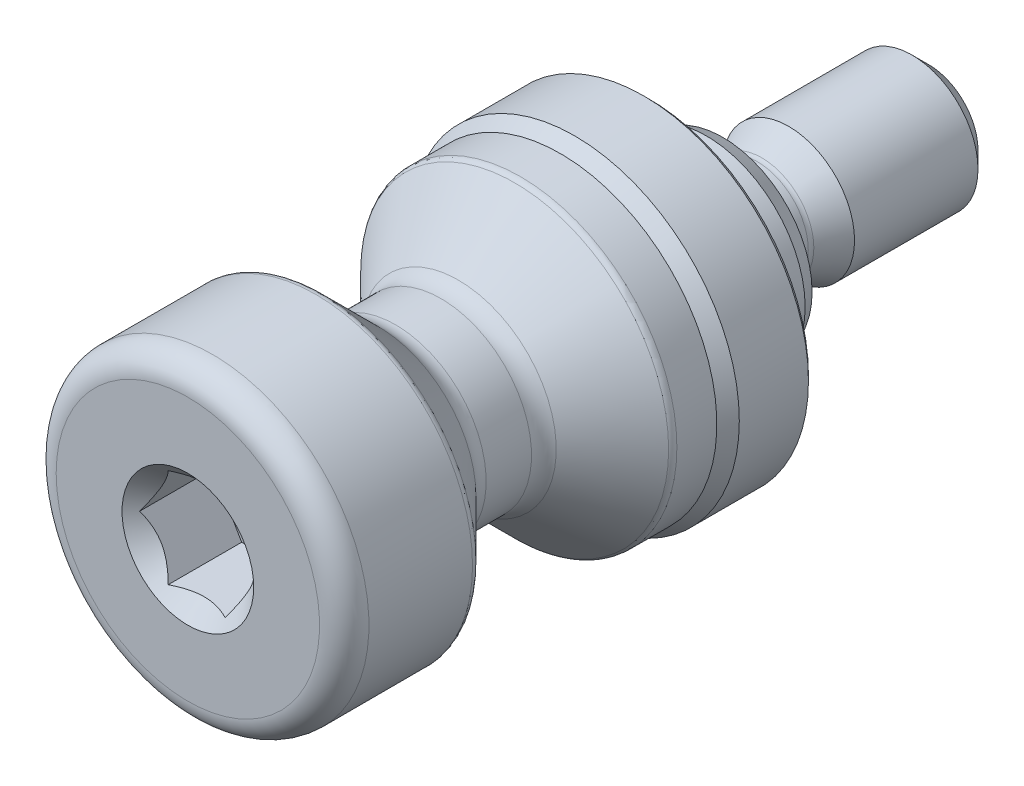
ISO-10303-21;
HEADER;
FILE_DESCRIPTION(('STEP AP214'),'2;1');
FILE_NAME('part.step','',(''),(''),'','','');
FILE_SCHEMA(('AUTOMOTIVE_DESIGN { 1 0 10303 214 1 1 1 1 }'));
ENDSEC;
DATA;
#1=APPLICATION_CONTEXT('core data for automotive mechanical design processes');
#2=APPLICATION_PROTOCOL_DEFINITION('international standard','automotive_design',2000,#1);
#3=PRODUCT_CONTEXT('',#1,'mechanical');
#4=PRODUCT('Part','Part','',(#3));
#5=PRODUCT_RELATED_PRODUCT_CATEGORY('part','',(#4));
#6=PRODUCT_DEFINITION_FORMATION('','',#4);
#7=PRODUCT_DEFINITION_CONTEXT('part definition',#1,'design');
#8=PRODUCT_DEFINITION('design','',#6,#7);
#9=PRODUCT_DEFINITION_SHAPE('','',#8);
#10=(LENGTH_UNIT() NAMED_UNIT(*) SI_UNIT(.MILLI.,.METRE.));
#11=(NAMED_UNIT(*) PLANE_ANGLE_UNIT() SI_UNIT($,.RADIAN.));
#12=(NAMED_UNIT(*) SI_UNIT($,.STERADIAN.) SOLID_ANGLE_UNIT());
#13=UNCERTAINTY_MEASURE_WITH_UNIT(LENGTH_MEASURE(1.E-05),#10,'distance_accuracy_value','');
#14=(GEOMETRIC_REPRESENTATION_CONTEXT(3) GLOBAL_UNCERTAINTY_ASSIGNED_CONTEXT((#13)) GLOBAL_UNIT_ASSIGNED_CONTEXT((#10,
#11,#12)) REPRESENTATION_CONTEXT('',''));
#15=CARTESIAN_POINT('',(0.,0.,0.));
#16=DIRECTION('',(0.,0.,1.));
#17=DIRECTION('',(1.,0.,0.));
#18=AXIS2_PLACEMENT_3D('',#15,#16,#17);
#19=CARTESIAN_POINT('',(0.,0.,-17.));
#20=DIRECTION('',(0.,0.,-1.));
#21=DIRECTION('',(-1.,0.,0.));
#22=AXIS2_PLACEMENT_3D('',#19,#20,#21);
#23=CYLINDRICAL_SURFACE('',#22,9.5);
#24=CARTESIAN_POINT('',(0.,0.,7.79289321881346));
#25=DIRECTION('',(0.,0.,1.));
#26=DIRECTION('',(1.,0.,0.));
#27=AXIS2_PLACEMENT_3D('',#24,#25,#26);
#28=CIRCLE('',#27,9.5);
#29=CARTESIAN_POINT('',(9.5,0.,7.79289321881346));
#30=VERTEX_POINT('',#29);
#31=EDGE_CURVE('E235',#30,#30,#28,.F.);
#32=ORIENTED_EDGE('',*,*,#31,.T.);
#33=EDGE_LOOP('',(#32));
#34=FACE_BOUND('',#33,.T.);
#35=CARTESIAN_POINT('',(0.,0.,5.36602540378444));
#36=DIRECTION('',(0.,0.,-1.));
#37=DIRECTION('',(-1.,0.,0.));
#38=AXIS2_PLACEMENT_3D('',#35,#36,#37);
#39=CIRCLE('',#38,9.5);
#40=CARTESIAN_POINT('',(-9.5,0.,5.36602540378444));
#41=VERTEX_POINT('',#40);
#42=EDGE_CURVE('E115',#41,#41,#39,.T.);
#43=ORIENTED_EDGE('',*,*,#42,.F.);
#44=EDGE_LOOP('',(#43));
#45=FACE_BOUND('',#44,.T.);
#46=ADVANCED_FACE('F14',(#34,#45),#23,.T.);
#47=CARTESIAN_POINT('',(0.,4.,-4.5));
#48=DIRECTION('',(0.,0.,1.));
#49=DIRECTION('',(1.,0.,0.));
#50=AXIS2_PLACEMENT_3D('',#47,#48,#49);
#51=PLANE('',#50);
#52=CARTESIAN_POINT('',(0.,0.,-4.5));
#53=DIRECTION('',(0.,0.,1.));
#54=DIRECTION('',(1.,0.,0.));
#55=AXIS2_PLACEMENT_3D('',#52,#53,#54);
#56=CIRCLE('',#55,5.42264973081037);
#57=CARTESIAN_POINT('',(5.42264973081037,0.,-4.5));
#58=VERTEX_POINT('',#57);
#59=EDGE_CURVE('E263',#58,#58,#56,.F.);
#60=ORIENTED_EDGE('',*,*,#59,.T.);
#61=EDGE_LOOP('',(#60));
#62=FACE_BOUND('',#61,.T.);
#63=CARTESIAN_POINT('',(0.,0.,-4.5));
#64=DIRECTION('',(0.,0.,1.));
#65=DIRECTION('',(1.,0.,0.));
#66=AXIS2_PLACEMENT_3D('',#63,#64,#65);
#67=CIRCLE('',#66,3.7);
#68=CARTESIAN_POINT('',(3.7,0.,-4.5));
#69=VERTEX_POINT('',#68);
#70=EDGE_CURVE('E309',#69,#69,#67,.T.);
#71=ORIENTED_EDGE('',*,*,#70,.T.);
#72=EDGE_LOOP('',(#71));
#73=FACE_BOUND('',#72,.T.);
#74=ADVANCED_FACE('F202',(#62,#73),#51,.F.);
#75=CARTESIAN_POINT('',(0.,0.,-17.));
#76=DIRECTION('',(0.,0.,-1.));
#77=DIRECTION('',(-1.,0.,0.));
#78=AXIS2_PLACEMENT_3D('',#75,#76,#77);
#79=CYLINDRICAL_SURFACE('',#78,6.);
#80=CARTESIAN_POINT('',(0.,0.,-3.5));
#81=DIRECTION('',(0.,0.,1.));
#82=DIRECTION('',(1.,0.,0.));
#83=AXIS2_PLACEMENT_3D('',#80,#81,#82);
#84=CIRCLE('',#83,6.);
#85=CARTESIAN_POINT('',(6.,0.,-3.5));
#86=VERTEX_POINT('',#85);
#87=EDGE_CURVE('E266',#86,#86,#84,.T.);
#88=ORIENTED_EDGE('',*,*,#87,.T.);
#89=EDGE_LOOP('',(#88));
#90=FACE_BOUND('',#89,.T.);
#91=CARTESIAN_POINT('',(0.,0.,0.));
#92=DIRECTION('',(0.,0.,-1.));
#93=DIRECTION('',(-1.,0.,0.));
#94=AXIS2_PLACEMENT_3D('',#91,#92,#93);
#95=CIRCLE('',#94,6.);
#96=CARTESIAN_POINT('',(-6.,0.,0.));
#97=VERTEX_POINT('',#96);
#98=EDGE_CURVE('E121',#97,#97,#95,.T.);
#99=ORIENTED_EDGE('',*,*,#98,.T.);
#100=EDGE_LOOP('',(#99));
#101=FACE_BOUND('',#100,.T.);
#102=ADVANCED_FACE('F209',(#90,#101),#79,.T.);
#103=CARTESIAN_POINT('',(0.,6.,0.));
#104=DIRECTION('',(0.,0.,1.));
#105=DIRECTION('',(1.,0.,0.));
#106=AXIS2_PLACEMENT_3D('',#103,#104,#105);
#107=PLANE('',#106);
#108=CARTESIAN_POINT('',(0.,0.,0.));
#109=DIRECTION('',(0.,0.,1.));
#110=DIRECTION('',(1.,0.,0.));
#111=AXIS2_PLACEMENT_3D('',#108,#109,#110);
#112=CIRCLE('',#111,9.7);
#113=CARTESIAN_POINT('',(9.7,0.,0.));
#114=VERTEX_POINT('',#113);
#115=EDGE_CURVE('E269',#114,#114,#112,.F.);
#116=ORIENTED_EDGE('',*,*,#115,.T.);
#117=EDGE_LOOP('',(#116));
#118=FACE_BOUND('',#117,.T.);
#119=ORIENTED_EDGE('',*,*,#98,.F.);
#120=EDGE_LOOP('',(#119));
#121=FACE_BOUND('',#120,.T.);
#122=ADVANCED_FACE('F361',(#118,#121),#107,.F.);
#123=CARTESIAN_POINT('',(0.,0.,-17.));
#124=DIRECTION('',(0.,0.,-1.));
#125=DIRECTION('',(-1.,0.,0.));
#126=AXIS2_PLACEMENT_3D('',#123,#124,#125);
#127=CYLINDRICAL_SURFACE('',#126,10.);
#128=CARTESIAN_POINT('',(0.,0.,0.299999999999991));
#129=DIRECTION('',(0.,0.,1.));
#130=DIRECTION('',(1.,0.,0.));
#131=AXIS2_PLACEMENT_3D('',#128,#129,#130);
#132=CIRCLE('',#131,10.);
#133=CARTESIAN_POINT('',(10.,0.,0.299999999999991));
#134=VERTEX_POINT('',#133);
#135=EDGE_CURVE('E272',#134,#134,#132,.T.);
#136=ORIENTED_EDGE('',*,*,#135,.T.);
#137=EDGE_LOOP('',(#136));
#138=FACE_BOUND('',#137,.T.);
#139=CARTESIAN_POINT('',(0.,0.,4.5));
#140=DIRECTION('',(0.,0.,-1.));
#141=DIRECTION('',(-1.,0.,0.));
#142=AXIS2_PLACEMENT_3D('',#139,#140,#141);
#143=CIRCLE('',#142,10.);
#144=CARTESIAN_POINT('',(-10.,0.,4.5));
#145=VERTEX_POINT('',#144);
#146=EDGE_CURVE('E118',#145,#145,#143,.T.);
#147=ORIENTED_EDGE('',*,*,#146,.T.);
#148=EDGE_LOOP('',(#147));
#149=FACE_BOUND('',#148,.T.);
#150=ADVANCED_FACE('F366',(#138,#149),#127,.T.);
#151=CARTESIAN_POINT('',(0.,0.,5.36602540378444));
#152=DIRECTION('',(0.,0.,-1.));
#153=DIRECTION('',(-1.,0.,0.));
#154=AXIS2_PLACEMENT_3D('',#151,#152,#153);
#155=CONICAL_SURFACE('',#154,9.5,0.523598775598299);
#156=ORIENTED_EDGE('',*,*,#146,.F.);
#157=EDGE_LOOP('',(#156));
#158=FACE_BOUND('',#157,.T.);
#159=ORIENTED_EDGE('',*,*,#42,.T.);
#160=EDGE_LOOP('',(#159));
#161=FACE_BOUND('',#160,.T.);
#162=ADVANCED_FACE('F372',(#158,#161),#155,.T.);
#163=CARTESIAN_POINT('',(0.,0.,8.));
#164=DIRECTION('',(0.,0.,-1.));
#165=DIRECTION('',(-1.,0.,0.));
#166=AXIS2_PLACEMENT_3D('',#163,#164,#165);
#167=CONICAL_SURFACE('',#166,9.5,0.78539816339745);
#168=CARTESIAN_POINT('',(0.,0.,11.5606601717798));
#169=DIRECTION('',(0.,0.,-1.));
#170=DIRECTION('',(-1.,0.,0.));
#171=AXIS2_PLACEMENT_3D('',#168,#169,#170);
#172=CIRCLE('',#171,5.93933982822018);
#173=CARTESIAN_POINT('',(-5.93933982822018,0.,11.5606601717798));
#174=VERTEX_POINT('',#173);
#175=EDGE_CURVE('E247',#174,#174,#172,.T.);
#176=ORIENTED_EDGE('',*,*,#175,.T.);
#177=EDGE_LOOP('',(#176));
#178=FACE_BOUND('',#177,.T.);
#179=CARTESIAN_POINT('',(0.,0.,8.14644660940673));
#180=DIRECTION('',(0.,0.,-1.));
#181=DIRECTION('',(-1.,0.,0.));
#182=AXIS2_PLACEMENT_3D('',#179,#180,#181);
#183=CIRCLE('',#182,9.35355339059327);
#184=CARTESIAN_POINT('',(-9.35355339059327,0.,8.14644660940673));
#185=VERTEX_POINT('',#184);
#186=EDGE_CURVE('E238',#185,#185,#183,.F.);
#187=ORIENTED_EDGE('',*,*,#186,.T.);
#188=EDGE_LOOP('',(#187));
#189=FACE_BOUND('',#188,.T.);
#190=ADVANCED_FACE('F376',(#178,#189),#167,.T.);
#191=CARTESIAN_POINT('',(0.,0.,0.));
#192=DIRECTION('',(0.,0.,-1.));
#193=DIRECTION('',(-1.,0.,0.));
#194=AXIS2_PLACEMENT_3D('',#191,#192,#193);
#195=CYLINDRICAL_SURFACE('',#194,5.5);
#196=CARTESIAN_POINT('',(0.,0.,12.6213203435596));
#197=DIRECTION('',(0.,0.,-1.));
#198=DIRECTION('',(-1.,0.,0.));
#199=AXIS2_PLACEMENT_3D('',#196,#197,#198);
#200=CIRCLE('',#199,5.5);
#201=CARTESIAN_POINT('',(-5.5,0.,12.6213203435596));
#202=VERTEX_POINT('',#201);
#203=EDGE_CURVE('E253',#202,#202,#200,.F.);
#204=ORIENTED_EDGE('',*,*,#203,.T.);
#205=EDGE_LOOP('',(#204));
#206=FACE_BOUND('',#205,.T.);
#207=CARTESIAN_POINT('',(0.,0.,15.3786796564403));
#208=DIRECTION('',(0.,0.,-1.));
#209=DIRECTION('',(-1.,0.,0.));
#210=AXIS2_PLACEMENT_3D('',#207,#208,#209);
#211=CIRCLE('',#210,5.5);
#212=CARTESIAN_POINT('',(-5.5,0.,15.3786796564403));
#213=VERTEX_POINT('',#212);
#214=EDGE_CURVE('E250',#213,#213,#211,.T.);
#215=ORIENTED_EDGE('',*,*,#214,.T.);
#216=EDGE_LOOP('',(#215));
#217=FACE_BOUND('',#216,.T.);
#218=ADVANCED_FACE('F381',(#206,#217),#195,.T.);
#219=CARTESIAN_POINT('',(0.,0.,16.));
#220=DIRECTION('',(0.,0.,1.));
#221=DIRECTION('',(1.,0.,0.));
#222=AXIS2_PLACEMENT_3D('',#219,#220,#221);
#223=CONICAL_SURFACE('',#222,5.5,0.78539816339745);
#224=CARTESIAN_POINT('',(0.,0.,16.4393398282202));
#225=DIRECTION('',(0.,0.,1.));
#226=DIRECTION('',(1.,0.,0.));
#227=AXIS2_PLACEMENT_3D('',#224,#225,#226);
#228=CIRCLE('',#227,5.93933982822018);
#229=CARTESIAN_POINT('',(5.93933982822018,0.,16.4393398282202));
#230=VERTEX_POINT('',#229);
#231=EDGE_CURVE('E256',#230,#230,#228,.T.);
#232=ORIENTED_EDGE('',*,*,#231,.T.);
#233=EDGE_LOOP('',(#232));
#234=FACE_BOUND('',#233,.T.);
#235=CARTESIAN_POINT('',(0.,0.,19.8535533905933));
#236=DIRECTION('',(0.,0.,1.));
#237=DIRECTION('',(1.,0.,0.));
#238=AXIS2_PLACEMENT_3D('',#235,#236,#237);
#239=CIRCLE('',#238,9.35355339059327);
#240=CARTESIAN_POINT('',(9.35355339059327,0.,19.8535533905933));
#241=VERTEX_POINT('',#240);
#242=EDGE_CURVE('E236',#241,#241,#239,.F.);
#243=ORIENTED_EDGE('',*,*,#242,.T.);
#244=EDGE_LOOP('',(#243));
#245=FACE_BOUND('',#244,.T.);
#246=ADVANCED_FACE('F225',(#234,#245),#223,.T.);
#247=CARTESIAN_POINT('',(0.,9.5,28.));
#248=DIRECTION('',(0.,0.,-1.));
#249=DIRECTION('',(-1.,0.,0.));
#250=AXIS2_PLACEMENT_3D('',#247,#248,#249);
#251=PLANE('',#250);
#252=CARTESIAN_POINT('',(0.,0.,28.));
#253=DIRECTION('',(0.,0.,-1.));
#254=DIRECTION('',(-1.,0.,0.));
#255=AXIS2_PLACEMENT_3D('',#252,#253,#254);
#256=CIRCLE('',#255,8.);
#257=CARTESIAN_POINT('',(-8.,0.,28.));
#258=VERTEX_POINT('',#257);
#259=EDGE_CURVE('E260',#258,#258,#256,.F.);
#260=ORIENTED_EDGE('',*,*,#259,.T.);
#261=EDGE_LOOP('',(#260));
#262=FACE_BOUND('',#261,.T.);
#263=CARTESIAN_POINT('',(0.,0.,28.));
#264=DIRECTION('',(0.,0.,1.));
#265=DIRECTION('',(1.,0.,0.));
#266=AXIS2_PLACEMENT_3D('',#263,#264,#265);
#267=CIRCLE('',#266,4.);
#268=CARTESIAN_POINT('',(4.,0.,28.));
#269=VERTEX_POINT('',#268);
#270=EDGE_CURVE('E100',#269,#269,#267,.T.);
#271=ORIENTED_EDGE('',*,*,#270,.F.);
#272=EDGE_LOOP('',(#271));
#273=FACE_BOUND('',#272,.T.);
#274=ADVANCED_FACE('F218',(#262,#273),#251,.F.);
#275=CARTESIAN_POINT('',(0.,0.,26.5));
#276=DIRECTION('',(0.,0.,-1.));
#277=DIRECTION('',(-1.,0.,0.));
#278=AXIS2_PLACEMENT_3D('',#275,#276,#277);
#279=CIRCLE('',#278,9.5);
#280=CARTESIAN_POINT('',(-9.5,0.,26.5));
#281=VERTEX_POINT('',#280);
#282=EDGE_CURVE('E230',#281,#281,#279,.T.);
#283=ORIENTED_EDGE('',*,*,#282,.T.);
#284=EDGE_LOOP('',(#283));
#285=FACE_BOUND('',#284,.T.);
#286=CARTESIAN_POINT('',(0.,0.,20.2071067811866));
#287=DIRECTION('',(0.,0.,1.));
#288=DIRECTION('',(1.,0.,0.));
#289=AXIS2_PLACEMENT_3D('',#286,#287,#288);
#290=CIRCLE('',#289,9.5);
#291=CARTESIAN_POINT('',(9.5,0.,20.2071067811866));
#292=VERTEX_POINT('',#291);
#293=EDGE_CURVE('E233',#292,#292,#290,.T.);
#294=ORIENTED_EDGE('',*,*,#293,.T.);
#295=EDGE_LOOP('',(#294));
#296=FACE_BOUND('',#295,.T.);
#297=ADVANCED_FACE('F205',(#285,#296),#23,.T.);
#298=CARTESIAN_POINT('',(0.,0.,0.));
#299=DIRECTION('',(0.,0.,1.));
#300=DIRECTION('',(1.,0.,0.));
#301=AXIS2_PLACEMENT_3D('',#298,#299,#300);
#302=CYLINDRICAL_SURFACE('',#301,3.1);
#303=CARTESIAN_POINT('',(0.,0.,-5.1));
#304=DIRECTION('',(0.,0.,1.));
#305=DIRECTION('',(1.,0.,0.));
#306=AXIS2_PLACEMENT_3D('',#303,#304,#305);
#307=CIRCLE('',#306,3.1);
#308=CARTESIAN_POINT('',(3.1,0.,-5.1));
#309=VERTEX_POINT('',#308);
#310=EDGE_CURVE('E303',#309,#309,#307,.F.);
#311=ORIENTED_EDGE('',*,*,#310,.T.);
#312=EDGE_LOOP('',(#311));
#313=FACE_BOUND('',#312,.T.);
#314=CARTESIAN_POINT('',(0.,0.,-6.5896032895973));
#315=DIRECTION('',(0.,0.,1.));
#316=DIRECTION('',(1.,0.,0.));
#317=AXIS2_PLACEMENT_3D('',#314,#315,#316);
#318=CIRCLE('',#317,3.1);
#319=CARTESIAN_POINT('',(3.1,0.,-6.5896032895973));
#320=VERTEX_POINT('',#319);
#321=EDGE_CURVE('E305',#320,#320,#318,.T.);
#322=ORIENTED_EDGE('',*,*,#321,.T.);
#323=EDGE_LOOP('',(#322));
#324=FACE_BOUND('',#323,.T.);
#325=ADVANCED_FACE('F217',(#313,#324),#302,.T.);
#326=CARTESIAN_POINT('',(0.,0.,-8.5));
#327=DIRECTION('',(0.,0.,-1.));
#328=DIRECTION('',(-1.,0.,0.));
#329=AXIS2_PLACEMENT_3D('',#326,#327,#328);
#330=CONICAL_SURFACE('',#329,4.,0.47123889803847);
#331=CARTESIAN_POINT('',(0.,0.,-6.86199758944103));
#332=DIRECTION('',(0.,0.,-1.));
#333=DIRECTION('',(-1.,0.,0.));
#334=AXIS2_PLACEMENT_3D('',#331,#332,#333);
#335=CIRCLE('',#334,3.16539608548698);
#336=CARTESIAN_POINT('',(-3.16539608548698,0.,-6.86199758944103));
#337=VERTEX_POINT('',#336);
#338=EDGE_CURVE('E241',#337,#337,#335,.T.);
#339=ORIENTED_EDGE('',*,*,#338,.T.);
#340=EDGE_LOOP('',(#339));
#341=FACE_BOUND('',#340,.T.);
#342=CARTESIAN_POINT('',(0.,0.,-8.5));
#343=DIRECTION('',(0.,0.,1.));
#344=DIRECTION('',(1.,0.,0.));
#345=AXIS2_PLACEMENT_3D('',#342,#343,#344);
#346=CIRCLE('',#345,4.);
#347=CARTESIAN_POINT('',(4.,0.,-8.5));
#348=VERTEX_POINT('',#347);
#349=EDGE_CURVE('E112',#348,#348,#346,.T.);
#350=ORIENTED_EDGE('',*,*,#349,.T.);
#351=EDGE_LOOP('',(#350));
#352=FACE_BOUND('',#351,.T.);
#353=ADVANCED_FACE('F148',(#341,#352),#330,.T.);
#354=CARTESIAN_POINT('',(0.,0.,-17.));
#355=DIRECTION('',(0.,0.,1.));
#356=DIRECTION('',(1.,0.,0.));
#357=AXIS2_PLACEMENT_3D('',#354,#355,#356);
#358=PLANE('',#357);
#359=CARTESIAN_POINT('',(0.,0.,-17.));
#360=DIRECTION('',(0.,0.,1.));
#361=DIRECTION('',(1.,0.,0.));
#362=AXIS2_PLACEMENT_3D('',#359,#360,#361);
#363=CIRCLE('',#362,3.);
#364=CARTESIAN_POINT('',(3.,0.,-17.));
#365=VERTEX_POINT('',#364);
#366=EDGE_CURVE('E22',#365,#365,#363,.F.);
#367=ORIENTED_EDGE('',*,*,#366,.T.);
#368=EDGE_LOOP('',(#367));
#369=FACE_BOUND('',#368,.T.);
#370=ADVANCED_FACE('F277',(#369),#358,.F.);
#371=CARTESIAN_POINT('',(0.,0.,-17.));
#372=DIRECTION('',(0.,0.,-1.));
#373=DIRECTION('',(-1.,0.,0.));
#374=AXIS2_PLACEMENT_3D('',#371,#372,#373);
#375=CYLINDRICAL_SURFACE('',#374,4.);
#376=CARTESIAN_POINT('',(0.,0.,-16.));
#377=DIRECTION('',(0.,0.,1.));
#378=DIRECTION('',(1.,0.,0.));
#379=AXIS2_PLACEMENT_3D('',#376,#377,#378);
#380=CIRCLE('',#379,4.);
#381=CARTESIAN_POINT('',(4.,0.,-16.));
#382=VERTEX_POINT('',#381);
#383=EDGE_CURVE('E9',#382,#382,#380,.T.);
#384=ORIENTED_EDGE('',*,*,#383,.T.);
#385=EDGE_LOOP('',(#384));
#386=FACE_BOUND('',#385,.T.);
#387=ORIENTED_EDGE('',*,*,#349,.F.);
#388=EDGE_LOOP('',(#387));
#389=FACE_BOUND('',#388,.T.);
#390=ADVANCED_FACE('F145',(#386,#389),#375,.T.);
#391=CARTESIAN_POINT('',(0.,0.,28.));
#392=DIRECTION('',(0.,0.,1.));
#393=DIRECTION('',(1.,0.,0.));
#394=AXIS2_PLACEMENT_3D('',#391,#392,#393);
#395=CONICAL_SURFACE('',#394,4.,0.785398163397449);
#396=CARTESIAN_POINT('',(4.31417090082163,3.,29.2547188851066));
#397=CARTESIAN_POINT('',(4.20556655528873,3.,29.1655763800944));
#398=CARTESIAN_POINT('',(4.09644055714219,3.,29.0770594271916));
#399=CARTESIAN_POINT('',(3.87687889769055,3.,28.9016089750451));
#400=CARTESIAN_POINT('',(3.76644291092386,3.,28.8146758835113));
#401=CARTESIAN_POINT('',(3.5428272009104,3.,28.6418260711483));
#402=CARTESIAN_POINT('',(3.42963066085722,3.,28.5559310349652));
#403=CARTESIAN_POINT('',(3.20137110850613,3.,28.3866739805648));
#404=CARTESIAN_POINT('',(3.08630827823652,3.,28.3033117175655));
#405=CARTESIAN_POINT('',(2.84299675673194,3.,28.1321251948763));
#406=CARTESIAN_POINT('',(2.71452444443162,3.,28.0446169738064));
#407=CARTESIAN_POINT('',(2.45417043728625,3.,27.8746889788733));
#408=CARTESIAN_POINT('',(2.32228764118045,3.,27.7922708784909));
#409=CARTESIAN_POINT('',(2.05500752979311,3.,27.6347549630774));
#410=CARTESIAN_POINT('',(1.91962937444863,3.,27.5596249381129));
#411=CARTESIAN_POINT('',(1.64405080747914,3.,27.418900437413));
#412=CARTESIAN_POINT('',(1.50385471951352,3.,27.3532976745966));
#413=CARTESIAN_POINT('',(1.25928424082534,3.,27.2522685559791));
#414=CARTESIAN_POINT('',(1.15625925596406,3.,27.2135991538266));
#415=CARTESIAN_POINT('',(0.947418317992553,3.,27.1445027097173));
#416=CARTESIAN_POINT('',(0.841601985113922,3.,27.1140767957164));
#417=CARTESIAN_POINT('',(0.629948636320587,3.,27.0637428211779));
#418=CARTESIAN_POINT('',(0.524164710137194,3.,27.0436153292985));
#419=CARTESIAN_POINT('',(0.311086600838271,3.,27.0142427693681));
#420=CARTESIAN_POINT('',(0.203792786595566,3.,27.0049950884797));
#421=CARTESIAN_POINT('',(-0.00553816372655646,3.,26.9982768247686));
#422=CARTESIAN_POINT('',(-0.107556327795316,3.,27.0002148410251));
#423=CARTESIAN_POINT('',(-0.310871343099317,3.,27.0143576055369));
#424=CARTESIAN_POINT('',(-0.412168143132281,3.,27.0265630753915));
#425=CARTESIAN_POINT('',(-0.615080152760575,3.,27.0607380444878));
#426=CARTESIAN_POINT('',(-0.716663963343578,3.,27.0828909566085));
#427=CARTESIAN_POINT('',(-0.917551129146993,3.,27.1356827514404));
#428=CARTESIAN_POINT('',(-1.01685452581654,3.,27.1663214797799));
#429=CARTESIAN_POINT('',(-1.31591155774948,3.,27.2704779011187));
#430=CARTESIAN_POINT('',(-1.5117516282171,3.,27.3552582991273));
#431=CARTESIAN_POINT('',(-1.79840284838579,3.,27.4967635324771));
#432=CARTESIAN_POINT('',(-1.89294095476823,3.,27.5464289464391));
#433=CARTESIAN_POINT('',(-2.07988299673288,3.,27.6496345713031));
#434=CARTESIAN_POINT('',(-2.17228729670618,3.,27.703174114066));
#435=CARTESIAN_POINT('',(-2.3506857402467,3.,27.8106312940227));
#436=CARTESIAN_POINT('',(-2.43677095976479,3.,27.8643994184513));
#437=CARTESIAN_POINT('',(-2.60746404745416,3.,27.9742424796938));
#438=CARTESIAN_POINT('',(-2.69207180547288,3.,28.0303175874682));
#439=CARTESIAN_POINT('',(-2.85932644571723,3.,28.143911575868));
#440=CARTESIAN_POINT('',(-2.94198356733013,3.,28.2014154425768));
#441=CARTESIAN_POINT('',(-3.10616146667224,3.,28.3179776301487));
#442=CARTESIAN_POINT('',(-3.18768255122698,3.,28.377035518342));
#443=CARTESIAN_POINT('',(-3.26872675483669,3.,28.436730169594));
#444=B_SPLINE_CURVE_WITH_KNOTS('',3,(#396,#397,#398,#399,#400,#401,#402,#403,#404,#405,#406,
#407,#408,#409,#410,#411,#412,#413,#414,#415,#416,#417,#418,#419,#420,#421,#422,#423,#424,#425,
#426,#427,#428,#429,#430,#431,#432,#433,#434,#435,#436,#437,#438,#439,#440,#441,#442,#443),
.UNSPECIFIED.,.F.,.F.,(4,2,2,2,2,2,2,2,2,2,2,2,2,2,2,2,2,2,2,2,2,2,2,4),(0.,0.421518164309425,
0.84314334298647,1.26940433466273,1.69562399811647,2.16186559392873,2.62825966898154,
3.09248837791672,3.55631083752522,3.88616498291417,4.21606423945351,4.53860624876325,
4.86107078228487,5.16664793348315,5.47224656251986,5.78372724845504,6.09520226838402,
6.73345011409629,7.05379152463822,7.37407781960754,7.67853185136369,7.9830084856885,
8.28506559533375,8.58703947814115),.UNSPECIFIED.);
#445=CARTESIAN_POINT('',(-1.73205080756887,3.,27.4641016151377));
#446=VERTEX_POINT('',#445);
#447=CARTESIAN_POINT('',(1.73205080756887,3.,27.4641016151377));
#448=VERTEX_POINT('',#447);
#449=EDGE_CURVE('E124',#446,#448,#444,.F.);
#450=ORIENTED_EDGE('',*,*,#449,.T.);
#451=CARTESIAN_POINT('',(1.73193533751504,3.0002,27.4642170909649));
#452=CARTESIAN_POINT('',(1.79147372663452,2.89707648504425,27.4047299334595));
#453=CARTESIAN_POINT('',(1.85200767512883,2.79222861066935,27.3487365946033));
#454=CARTESIAN_POINT('',(1.97544301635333,2.57843232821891,27.2462142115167));
#455=CARTESIAN_POINT('',(2.03835614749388,2.46946358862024,27.199742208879));
#456=CARTESIAN_POINT('',(2.16521745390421,2.24973336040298,27.1201348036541));
#457=CARTESIAN_POINT('',(2.22913332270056,2.13902782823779,27.0867993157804));
#458=CARTESIAN_POINT('',(2.35837216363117,1.91517958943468,27.0354391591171));
#459=CARTESIAN_POINT('',(2.42369118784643,1.80204372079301,27.0173761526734));
#460=CARTESIAN_POINT('',(2.53626564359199,1.6070590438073,27.0010785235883));
#461=CARTESIAN_POINT('',(2.58337569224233,1.52546204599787,26.9986659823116));
#462=CARTESIAN_POINT('',(2.67751916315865,1.36240077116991,27.0027310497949));
#463=CARTESIAN_POINT('',(2.72455255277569,1.28093655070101,27.0092117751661));
#464=CARTESIAN_POINT('',(2.81817374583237,1.11877988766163,27.030693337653));
#465=CARTESIAN_POINT('',(2.86476099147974,1.0380884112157,27.045703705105));
#466=CARTESIAN_POINT('',(2.95713536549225,0.878091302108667,27.0834252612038));
#467=CARTESIAN_POINT('',(3.00292255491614,0.798785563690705,27.1061358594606));
#468=CARTESIAN_POINT('',(3.0842086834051,0.65799385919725,27.1528622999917));
#469=CARTESIAN_POINT('',(3.11988753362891,0.596196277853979,27.1756499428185));
#470=CARTESIAN_POINT('',(3.19060468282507,0.473710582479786,27.2248979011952));
#471=CARTESIAN_POINT('',(3.22564296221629,0.413022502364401,27.2513583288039));
#472=CARTESIAN_POINT('',(3.29496858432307,0.29294700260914,27.3073586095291));
#473=CARTESIAN_POINT('',(3.3292578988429,0.233556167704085,27.3368887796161));
#474=CARTESIAN_POINT('',(3.39720147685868,0.115874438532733,27.3986407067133));
#475=CARTESIAN_POINT('',(3.43085611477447,0.0575828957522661,27.4308608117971));
#476=CARTESIAN_POINT('',(3.4642170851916,-0.0002000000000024,27.4642170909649));
#477=B_SPLINE_CURVE_WITH_KNOTS('',3,(#451,#452,#453,#454,#455,#456,#457,#458,#459,#460,#461,
#462,#463,#464,#465,#466,#467,#468,#469,#470,#471,#472,#473,#474,#475,#476),.UNSPECIFIED.,.F.,
.F.,(4,2,2,2,2,2,2,2,2,2,2,2,4),(0.,0.399603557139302,0.801535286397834,1.19708369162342,
1.59163620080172,1.87398941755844,2.15644160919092,2.43921001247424,2.72195674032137,
2.94657516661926,3.17120044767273,3.39513752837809,3.61893808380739),.UNSPECIFIED.);
#478=CARTESIAN_POINT('',(3.46410161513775,0.,27.4641016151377));
#479=VERTEX_POINT('',#478);
#480=EDGE_CURVE('E72',#448,#479,#477,.T.);
#481=ORIENTED_EDGE('',*,*,#480,.T.);
#482=CARTESIAN_POINT('',(3.4642170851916,0.000199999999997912,27.4642170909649));
#483=CARTESIAN_POINT('',(3.40467869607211,-0.102923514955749,27.4047299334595));
#484=CARTESIAN_POINT('',(3.3441447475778,-0.20777138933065,27.3487365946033));
#485=CARTESIAN_POINT('',(3.2207094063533,-0.421567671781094,27.2462142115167));
#486=CARTESIAN_POINT('',(3.15779627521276,-0.530536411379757,27.1997422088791));
#487=CARTESIAN_POINT('',(3.03093496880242,-0.750266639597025,27.1201348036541));
#488=CARTESIAN_POINT('',(2.96701910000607,-0.860972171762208,27.0867993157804));
#489=CARTESIAN_POINT('',(2.83778025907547,-1.08482041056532,27.0354391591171));
#490=CARTESIAN_POINT('',(2.77246123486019,-1.19795627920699,27.0173761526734));
#491=CARTESIAN_POINT('',(2.65988677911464,-1.3929409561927,27.0010785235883));
#492=CARTESIAN_POINT('',(2.6127767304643,-1.47453795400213,26.9986659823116));
#493=CARTESIAN_POINT('',(2.51863325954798,-1.63759922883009,27.0027310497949));
#494=CARTESIAN_POINT('',(2.47159986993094,-1.71906344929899,27.0092117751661));
#495=CARTESIAN_POINT('',(2.37797867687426,-1.88122011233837,27.030693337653));
#496=CARTESIAN_POINT('',(2.3313914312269,-1.9619115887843,27.045703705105));
#497=CARTESIAN_POINT('',(2.23901705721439,-2.12190869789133,27.0834252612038));
#498=CARTESIAN_POINT('',(2.19322986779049,-2.2012144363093,27.1061358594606));
#499=CARTESIAN_POINT('',(2.11194373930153,-2.34200614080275,27.1528622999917));
#500=CARTESIAN_POINT('',(2.07626488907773,-2.40380372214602,27.1756499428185));
#501=CARTESIAN_POINT('',(2.00554773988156,-2.52628941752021,27.2248979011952));
#502=CARTESIAN_POINT('',(1.97050946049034,-2.5869774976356,27.251358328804));
#503=CARTESIAN_POINT('',(1.90118383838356,-2.70705299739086,27.3073586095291));
#504=CARTESIAN_POINT('',(1.86689452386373,-2.76644383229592,27.3368887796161));
#505=CARTESIAN_POINT('',(1.79895094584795,-2.88412556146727,27.3986407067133));
#506=CARTESIAN_POINT('',(1.76529630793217,-2.94241710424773,27.4308608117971));
#507=CARTESIAN_POINT('',(1.73193533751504,-3.0002,27.4642170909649));
#508=B_SPLINE_CURVE_WITH_KNOTS('',3,(#482,#483,#484,#485,#486,#487,#488,#489,#490,#491,#492,
#493,#494,#495,#496,#497,#498,#499,#500,#501,#502,#503,#504,#505,#506,#507),.UNSPECIFIED.,.F.,
.F.,(4,2,2,2,2,2,2,2,2,2,2,2,4),(0.,0.399603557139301,0.801535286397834,1.19708369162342,
1.59163620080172,1.87398941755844,2.15644160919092,2.43921001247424,2.72195674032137,
2.94657516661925,3.17120044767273,3.39513752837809,3.61893808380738),.UNSPECIFIED.);
#509=CARTESIAN_POINT('',(1.73205080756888,-3.,27.4641016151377));
#510=VERTEX_POINT('',#509);
#511=EDGE_CURVE('E37',#479,#510,#508,.T.);
#512=ORIENTED_EDGE('',*,*,#511,.T.);
#513=CARTESIAN_POINT('',(4.31417090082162,-3.,29.2547188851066));
#514=CARTESIAN_POINT('',(4.20556655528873,-3.,29.1655763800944));
#515=CARTESIAN_POINT('',(4.09644055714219,-3.,29.0770594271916));
#516=CARTESIAN_POINT('',(3.87687889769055,-3.,28.9016089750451));
#517=CARTESIAN_POINT('',(3.76644291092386,-3.,28.8146758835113));
#518=CARTESIAN_POINT('',(3.5428272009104,-3.,28.6418260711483));
#519=CARTESIAN_POINT('',(3.42963066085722,-3.,28.5559310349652));
#520=CARTESIAN_POINT('',(3.20137110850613,-3.,28.3866739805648));
#521=CARTESIAN_POINT('',(3.08630827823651,-3.,28.3033117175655));
#522=CARTESIAN_POINT('',(2.84299675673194,-3.,28.1321251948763));
#523=CARTESIAN_POINT('',(2.71452444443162,-3.,28.0446169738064));
#524=CARTESIAN_POINT('',(2.45417043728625,-3.,27.8746889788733));
#525=CARTESIAN_POINT('',(2.32228764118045,-3.,27.7922708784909));
#526=CARTESIAN_POINT('',(2.0550075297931,-3.,27.6347549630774));
#527=CARTESIAN_POINT('',(1.91962937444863,-3.,27.5596249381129));
#528=CARTESIAN_POINT('',(1.64405080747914,-3.,27.418900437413));
#529=CARTESIAN_POINT('',(1.50385471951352,-3.,27.3532976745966));
#530=CARTESIAN_POINT('',(1.25928424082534,-3.,27.2522685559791));
#531=CARTESIAN_POINT('',(1.15625925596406,-3.,27.2135991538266));
#532=CARTESIAN_POINT('',(0.947418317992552,-3.,27.1445027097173));
#533=CARTESIAN_POINT('',(0.841601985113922,-3.,27.1140767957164));
#534=CARTESIAN_POINT('',(0.629948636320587,-3.,27.0637428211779));
#535=CARTESIAN_POINT('',(0.524164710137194,-3.,27.0436153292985));
#536=CARTESIAN_POINT('',(0.311086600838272,-3.,27.0142427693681));
#537=CARTESIAN_POINT('',(0.203792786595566,-3.,27.0049950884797));
#538=CARTESIAN_POINT('',(-0.00553816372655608,-3.,26.9982768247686));
#539=CARTESIAN_POINT('',(-0.107556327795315,-3.,27.0002148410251));
#540=CARTESIAN_POINT('',(-0.310871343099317,-3.,27.0143576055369));
#541=CARTESIAN_POINT('',(-0.41216814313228,-3.,27.0265630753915));
#542=CARTESIAN_POINT('',(-0.615080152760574,-3.,27.0607380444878));
#543=CARTESIAN_POINT('',(-0.716663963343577,-3.,27.0828909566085));
#544=CARTESIAN_POINT('',(-0.917551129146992,-3.,27.1356827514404));
#545=CARTESIAN_POINT('',(-1.01685452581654,-3.,27.1663214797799));
#546=CARTESIAN_POINT('',(-1.31591155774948,-3.,27.2704779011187));
#547=CARTESIAN_POINT('',(-1.51175162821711,-3.,27.3552582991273));
#548=CARTESIAN_POINT('',(-1.79840284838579,-3.,27.4967635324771));
#549=CARTESIAN_POINT('',(-1.89294095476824,-3.,27.5464289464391));
#550=CARTESIAN_POINT('',(-2.07988299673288,-3.,27.6496345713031));
#551=CARTESIAN_POINT('',(-2.17228729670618,-3.,27.703174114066));
#552=CARTESIAN_POINT('',(-2.3506857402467,-3.,27.8106312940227));
#553=CARTESIAN_POINT('',(-2.43677095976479,-3.,27.8643994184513));
#554=CARTESIAN_POINT('',(-2.60746404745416,-3.,27.9742424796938));
#555=CARTESIAN_POINT('',(-2.69207180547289,-3.,28.0303175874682));
#556=CARTESIAN_POINT('',(-2.85932644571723,-3.,28.143911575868));
#557=CARTESIAN_POINT('',(-2.94198356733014,-3.,28.2014154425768));
#558=CARTESIAN_POINT('',(-3.10616146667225,-3.,28.3179776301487));
#559=CARTESIAN_POINT('',(-3.18768255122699,-3.,28.377035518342));
#560=CARTESIAN_POINT('',(-3.2687267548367,-3.,28.436730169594));
#561=B_SPLINE_CURVE_WITH_KNOTS('',3,(#513,#514,#515,#516,#517,#518,#519,#520,#521,#522,#523,
#524,#525,#526,#527,#528,#529,#530,#531,#532,#533,#534,#535,#536,#537,#538,#539,#540,#541,#542,
#543,#544,#545,#546,#547,#548,#549,#550,#551,#552,#553,#554,#555,#556,#557,#558,#559,#560),
.UNSPECIFIED.,.F.,.F.,(4,2,2,2,2,2,2,2,2,2,2,2,2,2,2,2,2,2,2,2,2,2,2,4),(0.,0.421518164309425,
0.843143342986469,1.26940433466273,1.69562399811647,2.16186559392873,2.62825966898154,
3.09248837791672,3.55631083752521,3.88616498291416,4.21606423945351,4.53860624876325,
4.86107078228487,5.16664793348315,5.47224656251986,5.78372724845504,6.09520226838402,
6.73345011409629,7.05379152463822,7.37407781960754,7.67853185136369,7.98300848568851,
8.28506559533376,8.58703947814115),.UNSPECIFIED.);
#562=CARTESIAN_POINT('',(-1.73205080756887,-3.,27.4641016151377));
#563=VERTEX_POINT('',#562);
#564=EDGE_CURVE('E163',#510,#563,#561,.T.);
#565=ORIENTED_EDGE('',*,*,#564,.T.);
#566=CARTESIAN_POINT('',(-1.73193533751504,-3.0002,27.4642170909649));
#567=CARTESIAN_POINT('',(-1.79147372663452,-2.89707648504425,27.4047299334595));
#568=CARTESIAN_POINT('',(-1.85200767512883,-2.79222861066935,27.3487365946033));
#569=CARTESIAN_POINT('',(-1.97544301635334,-2.57843232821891,27.2462142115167));
#570=CARTESIAN_POINT('',(-2.03835614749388,-2.46946358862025,27.1997422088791));
#571=CARTESIAN_POINT('',(-2.16521745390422,-2.24973336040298,27.1201348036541));
#572=CARTESIAN_POINT('',(-2.22913332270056,-2.1390278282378,27.0867993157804));
#573=CARTESIAN_POINT('',(-2.35837216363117,-1.91517958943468,27.0354391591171));
#574=CARTESIAN_POINT('',(-2.42369118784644,-1.80204372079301,27.0173761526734));
#575=CARTESIAN_POINT('',(-2.53626564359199,-1.6070590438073,27.0010785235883));
#576=CARTESIAN_POINT('',(-2.58337569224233,-1.52546204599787,26.9986659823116));
#577=CARTESIAN_POINT('',(-2.67751916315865,-1.36240077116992,27.0027310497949));
#578=CARTESIAN_POINT('',(-2.72455255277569,-1.28093655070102,27.0092117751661));
#579=CARTESIAN_POINT('',(-2.81817374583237,-1.11877988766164,27.030693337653));
#580=CARTESIAN_POINT('',(-2.86476099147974,-1.0380884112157,27.045703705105));
#581=CARTESIAN_POINT('',(-2.95713536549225,-0.878091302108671,27.0834252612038));
#582=CARTESIAN_POINT('',(-3.00292255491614,-0.798785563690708,27.1061358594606));
#583=CARTESIAN_POINT('',(-3.0842086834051,-0.657993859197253,27.1528622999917));
#584=CARTESIAN_POINT('',(-3.11988753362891,-0.596196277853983,27.1756499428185));
#585=CARTESIAN_POINT('',(-3.19060468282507,-0.473710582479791,27.2248979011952));
#586=CARTESIAN_POINT('',(-3.22564296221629,-0.413022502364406,27.2513583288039));
#587=CARTESIAN_POINT('',(-3.29496858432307,-0.292947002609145,27.3073586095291));
#588=CARTESIAN_POINT('',(-3.3292578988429,-0.233556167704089,27.3368887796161));
#589=CARTESIAN_POINT('',(-3.39720147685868,-0.115874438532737,27.3986407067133));
#590=CARTESIAN_POINT('',(-3.43085611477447,-0.0575828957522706,27.4308608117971));
#591=CARTESIAN_POINT('',(-3.4642170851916,0.000199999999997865,27.4642170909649));
#592=B_SPLINE_CURVE_WITH_KNOTS('',3,(#566,#567,#568,#569,#570,#571,#572,#573,#574,#575,#576,
#577,#578,#579,#580,#581,#582,#583,#584,#585,#586,#587,#588,#589,#590,#591),.UNSPECIFIED.,.F.,
.F.,(4,2,2,2,2,2,2,2,2,2,2,2,4),(0.,0.399603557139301,0.801535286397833,1.19708369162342,
1.59163620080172,1.87398941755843,2.15644160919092,2.43921001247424,2.72195674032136,
2.94657516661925,3.17120044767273,3.39513752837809,3.61893808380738),.UNSPECIFIED.);
#593=CARTESIAN_POINT('',(-3.46410161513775,0.,27.4641016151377));
#594=VERTEX_POINT('',#593);
#595=EDGE_CURVE('E156',#563,#594,#592,.T.);
#596=ORIENTED_EDGE('',*,*,#595,.T.);
#597=CARTESIAN_POINT('',(-3.4642170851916,-0.000200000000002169,27.4642170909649));
#598=CARTESIAN_POINT('',(-3.40467869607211,0.102923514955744,27.4047299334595));
#599=CARTESIAN_POINT('',(-3.3441447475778,0.207771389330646,27.3487365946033));
#600=CARTESIAN_POINT('',(-3.2207094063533,0.42156767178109,27.2462142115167));
#601=CARTESIAN_POINT('',(-3.15779627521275,0.530536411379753,27.199742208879));
#602=CARTESIAN_POINT('',(-3.03093496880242,0.75026663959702,27.1201348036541));
#603=CARTESIAN_POINT('',(-2.96701910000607,0.860972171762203,27.0867993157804));
#604=CARTESIAN_POINT('',(-2.83778025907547,1.08482041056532,27.0354391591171));
#605=CARTESIAN_POINT('',(-2.7724612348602,1.19795627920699,27.0173761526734));
#606=CARTESIAN_POINT('',(-2.65988677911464,1.3929409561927,27.0010785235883));
#607=CARTESIAN_POINT('',(-2.6127767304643,1.47453795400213,26.9986659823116));
#608=CARTESIAN_POINT('',(-2.51863325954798,1.63759922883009,27.0027310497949));
#609=CARTESIAN_POINT('',(-2.47159986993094,1.71906344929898,27.0092117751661));
#610=CARTESIAN_POINT('',(-2.37797867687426,1.88122011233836,27.030693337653));
#611=CARTESIAN_POINT('',(-2.33139143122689,1.9619115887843,27.045703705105));
#612=CARTESIAN_POINT('',(-2.23901705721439,2.12190869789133,27.0834252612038));
#613=CARTESIAN_POINT('',(-2.19322986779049,2.20121443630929,27.1061358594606));
#614=CARTESIAN_POINT('',(-2.11194373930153,2.34200614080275,27.1528622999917));
#615=CARTESIAN_POINT('',(-2.07626488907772,2.40380372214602,27.1756499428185));
#616=CARTESIAN_POINT('',(-2.00554773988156,2.52628941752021,27.2248979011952));
#617=CARTESIAN_POINT('',(-1.97050946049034,2.5869774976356,27.2513583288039));
#618=CARTESIAN_POINT('',(-1.90118383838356,2.70705299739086,27.3073586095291));
#619=CARTESIAN_POINT('',(-1.86689452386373,2.76644383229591,27.3368887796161));
#620=CARTESIAN_POINT('',(-1.79895094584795,2.88412556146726,27.3986407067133));
#621=CARTESIAN_POINT('',(-1.76529630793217,2.94241710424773,27.4308608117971));
#622=CARTESIAN_POINT('',(-1.73193533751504,3.0002,27.4642170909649));
#623=B_SPLINE_CURVE_WITH_KNOTS('',3,(#597,#598,#599,#600,#601,#602,#603,#604,#605,#606,#607,
#608,#609,#610,#611,#612,#613,#614,#615,#616,#617,#618,#619,#620,#621,#622),.UNSPECIFIED.,.F.,
.F.,(4,2,2,2,2,2,2,2,2,2,2,2,4),(0.,0.399603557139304,0.801535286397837,1.19708369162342,
1.59163620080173,1.87398941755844,2.15644160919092,2.43921001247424,2.72195674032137,
2.94657516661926,3.17120044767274,3.39513752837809,3.61893808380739),.UNSPECIFIED.);
#624=EDGE_CURVE('E132',#594,#446,#623,.T.);
#625=ORIENTED_EDGE('',*,*,#624,.T.);
#626=EDGE_LOOP('',(#450,#481,#512,#565,#596,#625));
#627=FACE_BOUND('',#626,.T.);
#628=ORIENTED_EDGE('',*,*,#270,.T.);
#629=EDGE_LOOP('',(#628));
#630=FACE_BOUND('',#629,.T.);
#631=ADVANCED_FACE('F141',(#627,#630),#395,.F.);
#632=CARTESIAN_POINT('',(0.,0.,23.));
#633=DIRECTION('',(0.,0.,1.));
#634=DIRECTION('',(1.,0.,0.));
#635=AXIS2_PLACEMENT_3D('',#632,#633,#634);
#636=PLANE('',#635);
#637=DIRECTION('',(-0.5,0.866025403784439,0.));
#638=VECTOR('',#637,1.);
#639=CARTESIAN_POINT('',(3.46410161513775,0.,23.));
#640=LINE('',#639,#638);
#641=CARTESIAN_POINT('',(3.46410161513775,0.,23.));
#642=VERTEX_POINT('',#641);
#643=CARTESIAN_POINT('',(1.73205080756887,3.,23.));
#644=VERTEX_POINT('',#643);
#645=EDGE_CURVE('E69',#642,#644,#640,.T.);
#646=ORIENTED_EDGE('',*,*,#645,.T.);
#647=DIRECTION('',(-1.,0.,0.));
#648=VECTOR('',#647,1.);
#649=CARTESIAN_POINT('',(1.73205080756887,3.,23.));
#650=LINE('',#649,#648);
#651=CARTESIAN_POINT('',(-1.73205080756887,3.,23.));
#652=VERTEX_POINT('',#651);
#653=EDGE_CURVE('E78',#644,#652,#650,.T.);
#654=ORIENTED_EDGE('',*,*,#653,.T.);
#655=DIRECTION('',(-0.5,-0.866025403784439,0.));
#656=VECTOR('',#655,1.);
#657=CARTESIAN_POINT('',(-1.73205080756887,3.,23.));
#658=LINE('',#657,#656);
#659=CARTESIAN_POINT('',(-3.46410161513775,0.,23.));
#660=VERTEX_POINT('',#659);
#661=EDGE_CURVE('E84',#652,#660,#658,.T.);
#662=ORIENTED_EDGE('',*,*,#661,.T.);
#663=DIRECTION('',(0.5,-0.866025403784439,0.));
#664=VECTOR('',#663,1.);
#665=CARTESIAN_POINT('',(-3.46410161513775,0.,23.));
#666=LINE('',#665,#664);
#667=CARTESIAN_POINT('',(-1.73205080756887,-3.,23.));
#668=VERTEX_POINT('',#667);
#669=EDGE_CURVE('E92',#660,#668,#666,.T.);
#670=ORIENTED_EDGE('',*,*,#669,.T.);
#671=DIRECTION('',(1.,0.,0.));
#672=VECTOR('',#671,1.);
#673=CARTESIAN_POINT('',(-1.73205080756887,-3.,23.));
#674=LINE('',#673,#672);
#675=CARTESIAN_POINT('',(1.73205080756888,-3.,23.));
#676=VERTEX_POINT('',#675);
#677=EDGE_CURVE('E95',#668,#676,#674,.T.);
#678=ORIENTED_EDGE('',*,*,#677,.T.);
#679=DIRECTION('',(0.5,0.866025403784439,0.));
#680=VECTOR('',#679,1.);
#681=CARTESIAN_POINT('',(1.73205080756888,-3.,23.));
#682=LINE('',#681,#680);
#683=EDGE_CURVE('E75',#676,#642,#682,.T.);
#684=ORIENTED_EDGE('',*,*,#683,.T.);
#685=EDGE_LOOP('',(#646,#654,#662,#670,#678,#684));
#686=FACE_BOUND('',#685,.T.);
#687=ADVANCED_FACE('F86',(#686),#636,.T.);
#688=CARTESIAN_POINT('',(3.46410161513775,0.,23.));
#689=DIRECTION('',(0.866025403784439,0.5,0.));
#690=DIRECTION('',(-0.5,0.866025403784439,0.));
#691=AXIS2_PLACEMENT_3D('',#688,#689,#690);
#692=PLANE('',#691);
#693=DIRECTION('',(0.,0.,1.));
#694=VECTOR('',#693,1.);
#695=CARTESIAN_POINT('',(1.73205080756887,3.,23.));
#696=LINE('',#695,#694);
#697=EDGE_CURVE('E29',#644,#448,#696,.T.);
#698=ORIENTED_EDGE('',*,*,#697,.F.);
#699=ORIENTED_EDGE('',*,*,#645,.F.);
#700=DIRECTION('',(0.,0.,1.));
#701=VECTOR('',#700,1.);
#702=CARTESIAN_POINT('',(3.46410161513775,0.,23.));
#703=LINE('',#702,#701);
#704=EDGE_CURVE('E98',#642,#479,#703,.T.);
#705=ORIENTED_EDGE('',*,*,#704,.T.);
#706=ORIENTED_EDGE('',*,*,#480,.F.);
#707=EDGE_LOOP('',(#698,#699,#705,#706));
#708=FACE_BOUND('',#707,.T.);
#709=ADVANCED_FACE('F67',(#708),#692,.F.);
#710=CARTESIAN_POINT('',(1.73205080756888,-3.,23.));
#711=DIRECTION('',(0.866025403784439,-0.5,0.));
#712=DIRECTION('',(0.5,0.866025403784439,0.));
#713=AXIS2_PLACEMENT_3D('',#710,#711,#712);
#714=PLANE('',#713);
#715=ORIENTED_EDGE('',*,*,#704,.F.);
#716=ORIENTED_EDGE('',*,*,#683,.F.);
#717=DIRECTION('',(0.,0.,1.));
#718=VECTOR('',#717,1.);
#719=CARTESIAN_POINT('',(1.73205080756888,-3.,23.));
#720=LINE('',#719,#718);
#721=EDGE_CURVE('E101',#676,#510,#720,.T.);
#722=ORIENTED_EDGE('',*,*,#721,.T.);
#723=ORIENTED_EDGE('',*,*,#511,.F.);
#724=EDGE_LOOP('',(#715,#716,#722,#723));
#725=FACE_BOUND('',#724,.T.);
#726=ADVANCED_FACE('F180',(#725),#714,.F.);
#727=CARTESIAN_POINT('',(-1.73205080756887,-3.,23.));
#728=DIRECTION('',(0.,-1.,0.));
#729=DIRECTION('',(1.,0.,0.));
#730=AXIS2_PLACEMENT_3D('',#727,#728,#729);
#731=PLANE('',#730);
#732=ORIENTED_EDGE('',*,*,#721,.F.);
#733=ORIENTED_EDGE('',*,*,#677,.F.);
#734=DIRECTION('',(0.,0.,1.));
#735=VECTOR('',#734,1.);
#736=CARTESIAN_POINT('',(-1.73205080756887,-3.,23.));
#737=LINE('',#736,#735);
#738=EDGE_CURVE('E103',#668,#563,#737,.T.);
#739=ORIENTED_EDGE('',*,*,#738,.T.);
#740=ORIENTED_EDGE('',*,*,#564,.F.);
#741=EDGE_LOOP('',(#732,#733,#739,#740));
#742=FACE_BOUND('',#741,.T.);
#743=ADVANCED_FACE('F184',(#742),#731,.F.);
#744=CARTESIAN_POINT('',(-3.46410161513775,0.,23.));
#745=DIRECTION('',(-0.866025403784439,-0.5,0.));
#746=DIRECTION('',(0.5,-0.866025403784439,0.));
#747=AXIS2_PLACEMENT_3D('',#744,#745,#746);
#748=PLANE('',#747);
#749=ORIENTED_EDGE('',*,*,#738,.F.);
#750=ORIENTED_EDGE('',*,*,#669,.F.);
#751=DIRECTION('',(0.,0.,1.));
#752=VECTOR('',#751,1.);
#753=CARTESIAN_POINT('',(-3.46410161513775,0.,23.));
#754=LINE('',#753,#752);
#755=EDGE_CURVE('E106',#660,#594,#754,.T.);
#756=ORIENTED_EDGE('',*,*,#755,.T.);
#757=ORIENTED_EDGE('',*,*,#595,.F.);
#758=EDGE_LOOP('',(#749,#750,#756,#757));
#759=FACE_BOUND('',#758,.T.);
#760=ADVANCED_FACE('F187',(#759),#748,.F.);
#761=CARTESIAN_POINT('',(-1.73205080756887,3.,23.));
#762=DIRECTION('',(-0.866025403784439,0.5,0.));
#763=DIRECTION('',(-0.5,-0.866025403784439,0.));
#764=AXIS2_PLACEMENT_3D('',#761,#762,#763);
#765=PLANE('',#764);
#766=ORIENTED_EDGE('',*,*,#755,.F.);
#767=ORIENTED_EDGE('',*,*,#661,.F.);
#768=DIRECTION('',(0.,0.,1.));
#769=VECTOR('',#768,1.);
#770=CARTESIAN_POINT('',(-1.73205080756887,3.,23.));
#771=LINE('',#770,#769);
#772=EDGE_CURVE('E74',#652,#446,#771,.T.);
#773=ORIENTED_EDGE('',*,*,#772,.T.);
#774=ORIENTED_EDGE('',*,*,#624,.F.);
#775=EDGE_LOOP('',(#766,#767,#773,#774));
#776=FACE_BOUND('',#775,.T.);
#777=ADVANCED_FACE('F191',(#776),#765,.F.);
#778=CARTESIAN_POINT('',(1.73205080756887,3.,23.));
#779=DIRECTION('',(0.,1.,0.));
#780=DIRECTION('',(-1.,0.,0.));
#781=AXIS2_PLACEMENT_3D('',#778,#779,#780);
#782=PLANE('',#781);
#783=ORIENTED_EDGE('',*,*,#772,.F.);
#784=ORIENTED_EDGE('',*,*,#653,.F.);
#785=ORIENTED_EDGE('',*,*,#697,.T.);
#786=ORIENTED_EDGE('',*,*,#449,.F.);
#787=EDGE_LOOP('',(#783,#784,#785,#786));
#788=FACE_BOUND('',#787,.T.);
#789=ADVANCED_FACE('F79',(#788),#782,.F.);
#790=CARTESIAN_POINT('',(0.,0.,-5.1));
#791=DIRECTION('',(0.,0.,1.));
#792=DIRECTION('',(1.,0.,0.));
#793=AXIS2_PLACEMENT_3D('',#790,#791,#792);
#794=TOROIDAL_SURFACE('',#793,3.7,0.6);
#795=ORIENTED_EDGE('',*,*,#310,.F.);
#796=EDGE_LOOP('',(#795));
#797=FACE_BOUND('',#796,.T.);
#798=ORIENTED_EDGE('',*,*,#70,.F.);
#799=EDGE_LOOP('',(#798));
#800=FACE_BOUND('',#799,.T.);
#801=ADVANCED_FACE('F200',(#797,#800),#794,.F.);
#802=CARTESIAN_POINT('',(0.,0.,-6.5896032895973));
#803=DIRECTION('',(0.,0.,1.));
#804=DIRECTION('',(1.,0.,0.));
#805=AXIS2_PLACEMENT_3D('',#802,#803,#804);
#806=TOROIDAL_SURFACE('',#805,3.7,0.6);
#807=ORIENTED_EDGE('',*,*,#338,.F.);
#808=EDGE_LOOP('',(#807));
#809=FACE_BOUND('',#808,.T.);
#810=ORIENTED_EDGE('',*,*,#321,.F.);
#811=EDGE_LOOP('',(#810));
#812=FACE_BOUND('',#811,.T.);
#813=ADVANCED_FACE('F323',(#809,#812),#806,.F.);
#814=CARTESIAN_POINT('',(0.,0.,20.2071067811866));
#815=DIRECTION('',(0.,0.,1.));
#816=DIRECTION('',(1.,0.,0.));
#817=AXIS2_PLACEMENT_3D('',#814,#815,#816);
#818=TOROIDAL_SURFACE('',#817,9.,0.5);
#819=ORIENTED_EDGE('',*,*,#293,.F.);
#820=EDGE_LOOP('',(#819));
#821=FACE_BOUND('',#820,.T.);
#822=ORIENTED_EDGE('',*,*,#242,.F.);
#823=EDGE_LOOP('',(#822));
#824=FACE_BOUND('',#823,.T.);
#825=ADVANCED_FACE('F329',(#821,#824),#818,.T.);
#826=CARTESIAN_POINT('',(0.,0.,7.79289321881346));
#827=DIRECTION('',(0.,0.,1.));
#828=DIRECTION('',(1.,0.,0.));
#829=AXIS2_PLACEMENT_3D('',#826,#827,#828);
#830=TOROIDAL_SURFACE('',#829,9.,0.5);
#831=ORIENTED_EDGE('',*,*,#186,.F.);
#832=EDGE_LOOP('',(#831));
#833=FACE_BOUND('',#832,.T.);
#834=ORIENTED_EDGE('',*,*,#31,.F.);
#835=EDGE_LOOP('',(#834));
#836=FACE_BOUND('',#835,.T.);
#837=ADVANCED_FACE('F335',(#833,#836),#830,.T.);
#838=CARTESIAN_POINT('',(0.,0.,12.6213203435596));
#839=DIRECTION('',(0.,0.,-1.));
#840=DIRECTION('',(-1.,0.,0.));
#841=AXIS2_PLACEMENT_3D('',#838,#839,#840);
#842=TOROIDAL_SURFACE('',#841,7.,1.5);
#843=ORIENTED_EDGE('',*,*,#203,.F.);
#844=EDGE_LOOP('',(#843));
#845=FACE_BOUND('',#844,.T.);
#846=ORIENTED_EDGE('',*,*,#175,.F.);
#847=EDGE_LOOP('',(#846));
#848=FACE_BOUND('',#847,.T.);
#849=ADVANCED_FACE('F338',(#845,#848),#842,.F.);
#850=CARTESIAN_POINT('',(0.,0.,15.3786796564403));
#851=DIRECTION('',(0.,0.,-1.));
#852=DIRECTION('',(-1.,0.,0.));
#853=AXIS2_PLACEMENT_3D('',#850,#851,#852);
#854=TOROIDAL_SURFACE('',#853,7.,1.5);
#855=ORIENTED_EDGE('',*,*,#231,.F.);
#856=EDGE_LOOP('',(#855));
#857=FACE_BOUND('',#856,.T.);
#858=ORIENTED_EDGE('',*,*,#214,.F.);
#859=EDGE_LOOP('',(#858));
#860=FACE_BOUND('',#859,.T.);
#861=ADVANCED_FACE('F342',(#857,#860),#854,.F.);
#862=CARTESIAN_POINT('',(0.,0.,26.5));
#863=DIRECTION('',(0.,0.,-1.));
#864=DIRECTION('',(-1.,0.,0.));
#865=AXIS2_PLACEMENT_3D('',#862,#863,#864);
#866=TOROIDAL_SURFACE('',#865,8.,1.5);
#867=ORIENTED_EDGE('',*,*,#259,.F.);
#868=EDGE_LOOP('',(#867));
#869=FACE_BOUND('',#868,.T.);
#870=ORIENTED_EDGE('',*,*,#282,.F.);
#871=EDGE_LOOP('',(#870));
#872=FACE_BOUND('',#871,.T.);
#873=ADVANCED_FACE('F346',(#869,#872),#866,.T.);
#874=CARTESIAN_POINT('',(0.,0.,-4.5));
#875=DIRECTION('',(0.,0.,1.));
#876=DIRECTION('',(1.,0.,0.));
#877=AXIS2_PLACEMENT_3D('',#874,#875,#876);
#878=CONICAL_SURFACE('',#877,5.42264973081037,0.523598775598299);
#879=ORIENTED_EDGE('',*,*,#87,.F.);
#880=EDGE_LOOP('',(#879));
#881=FACE_BOUND('',#880,.T.);
#882=ORIENTED_EDGE('',*,*,#59,.F.);
#883=EDGE_LOOP('',(#882));
#884=FACE_BOUND('',#883,.T.);
#885=ADVANCED_FACE('F285',(#881,#884),#878,.T.);
#886=CARTESIAN_POINT('',(0.,0.,0.));
#887=DIRECTION('',(0.,0.,1.));
#888=DIRECTION('',(1.,0.,0.));
#889=AXIS2_PLACEMENT_3D('',#886,#887,#888);
#890=CONICAL_SURFACE('',#889,9.7,0.785398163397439);
#891=ORIENTED_EDGE('',*,*,#135,.F.);
#892=EDGE_LOOP('',(#891));
#893=FACE_BOUND('',#892,.T.);
#894=ORIENTED_EDGE('',*,*,#115,.F.);
#895=EDGE_LOOP('',(#894));
#896=FACE_BOUND('',#895,.T.);
#897=ADVANCED_FACE('F280',(#893,#896),#890,.T.);
#898=CARTESIAN_POINT('',(0.,0.,-17.));
#899=DIRECTION('',(0.,0.,1.));
#900=DIRECTION('',(1.,0.,0.));
#901=AXIS2_PLACEMENT_3D('',#898,#899,#900);
#902=CONICAL_SURFACE('',#901,3.,0.785398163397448);
#903=ORIENTED_EDGE('',*,*,#383,.F.);
#904=EDGE_LOOP('',(#903));
#905=FACE_BOUND('',#904,.T.);
#906=ORIENTED_EDGE('',*,*,#366,.F.);
#907=EDGE_LOOP('',(#906));
#908=FACE_BOUND('',#907,.T.);
#909=ADVANCED_FACE('F16',(#905,#908),#902,.T.);
#910=CLOSED_SHELL('',(#46,#74,#102,#122,#150,#162,#190,#218,#246,#274,#297,#325,#353,#370,#390,
#631,#687,#709,#726,#743,#760,#777,#789,#801,#813,#825,#837,#849,#861,#873,#885,#897,#909));
#911=MANIFOLD_SOLID_BREP('B1',#910);
#912=ADVANCED_BREP_SHAPE_REPRESENTATION('',(#18,#911),#14);
#913=SHAPE_DEFINITION_REPRESENTATION(#9,#912);
ENDSEC;
END-ISO-10303-21;
